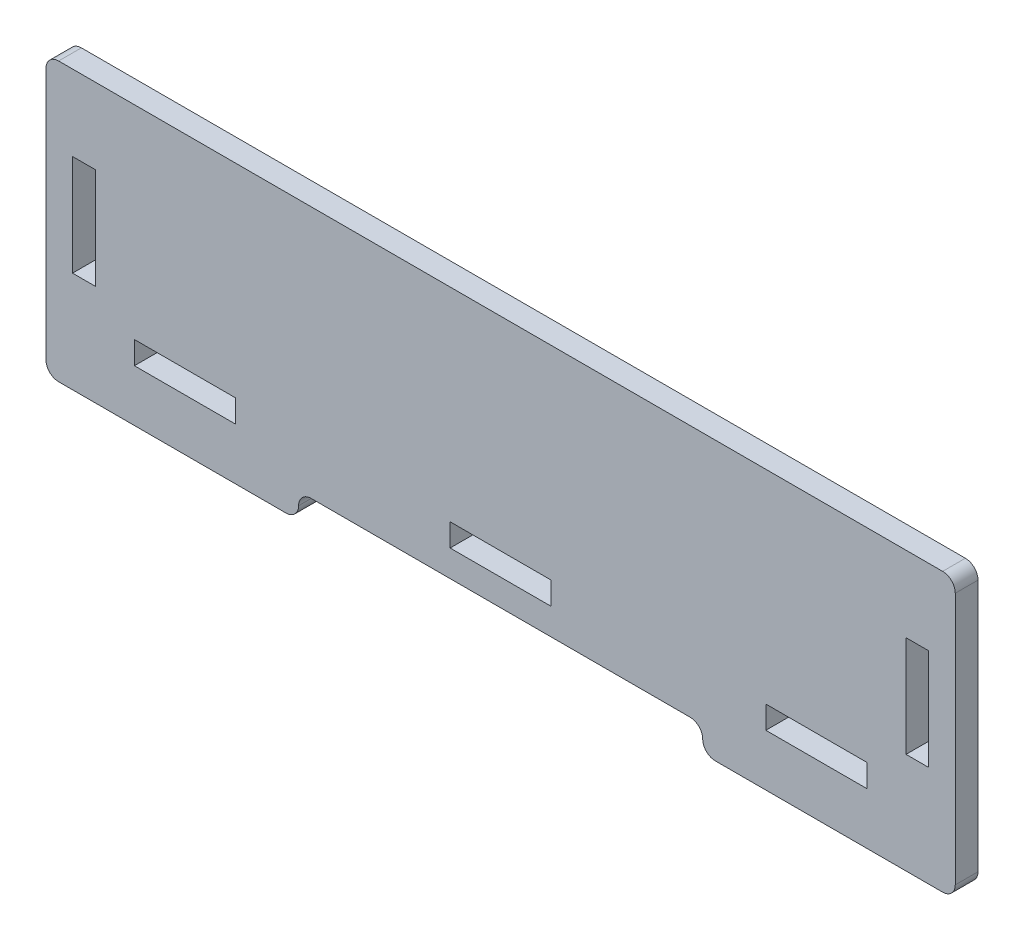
ISO-10303-21;
HEADER;
FILE_DESCRIPTION(('STEP AP214'),'2;1');
FILE_NAME('part.step','',(''),(''),'','','');
FILE_SCHEMA(('AUTOMOTIVE_DESIGN { 1 0 10303 214 1 1 1 1 }'));
ENDSEC;
DATA;
#1=APPLICATION_CONTEXT('core data for automotive mechanical design processes');
#2=APPLICATION_PROTOCOL_DEFINITION('international standard','automotive_design',2000,#1);
#3=PRODUCT_CONTEXT('',#1,'mechanical');
#4=PRODUCT('Part','Part','',(#3));
#5=PRODUCT_RELATED_PRODUCT_CATEGORY('part','',(#4));
#6=PRODUCT_DEFINITION_FORMATION('','',#4);
#7=PRODUCT_DEFINITION_CONTEXT('part definition',#1,'design');
#8=PRODUCT_DEFINITION('design','',#6,#7);
#9=PRODUCT_DEFINITION_SHAPE('','',#8);
#10=(LENGTH_UNIT() NAMED_UNIT(*) SI_UNIT(.MILLI.,.METRE.));
#11=(NAMED_UNIT(*) PLANE_ANGLE_UNIT() SI_UNIT($,.RADIAN.));
#12=(NAMED_UNIT(*) SI_UNIT($,.STERADIAN.) SOLID_ANGLE_UNIT());
#13=UNCERTAINTY_MEASURE_WITH_UNIT(LENGTH_MEASURE(1.E-05),#10,'distance_accuracy_value','');
#14=(GEOMETRIC_REPRESENTATION_CONTEXT(3) GLOBAL_UNCERTAINTY_ASSIGNED_CONTEXT((#13)) GLOBAL_UNIT_ASSIGNED_CONTEXT((#10,
#11,#12)) REPRESENTATION_CONTEXT('',''));
#15=CARTESIAN_POINT('',(0.,0.,0.));
#16=DIRECTION('',(0.,0.,1.));
#17=DIRECTION('',(1.,0.,0.));
#18=AXIS2_PLACEMENT_3D('',#15,#16,#17);
#19=CARTESIAN_POINT('',(-360.,-100.,18.));
#20=DIRECTION('',(0.,1.,0.));
#21=DIRECTION('',(0.,0.,1.));
#22=AXIS2_PLACEMENT_3D('',#19,#20,#21);
#23=PLANE('',#22);
#24=DIRECTION('',(1.,0.,0.));
#25=VECTOR('',#24,1.);
#26=CARTESIAN_POINT('',(-360.,-100.,0.));
#27=LINE('',#26,#25);
#28=CARTESIAN_POINT('',(-150.,-100.,0.));
#29=VERTEX_POINT('',#28);
#30=CARTESIAN_POINT('',(150.,-100.,0.));
#31=VERTEX_POINT('',#30);
#32=EDGE_CURVE('E521',#29,#31,#27,.T.);
#33=ORIENTED_EDGE('',*,*,#32,.T.);
#34=DIRECTION('',(0.,0.,1.));
#35=VECTOR('',#34,1.);
#36=CARTESIAN_POINT('',(150.,-100.,18.));
#37=LINE('',#36,#35);
#38=CARTESIAN_POINT('',(150.,-100.,18.));
#39=VERTEX_POINT('',#38);
#40=EDGE_CURVE('E556',#31,#39,#37,.T.);
#41=ORIENTED_EDGE('',*,*,#40,.T.);
#42=DIRECTION('',(1.,0.,0.));
#43=VECTOR('',#42,1.);
#44=CARTESIAN_POINT('',(-360.,-100.,18.));
#45=LINE('',#44,#43);
#46=CARTESIAN_POINT('',(-150.,-100.,18.));
#47=VERTEX_POINT('',#46);
#48=EDGE_CURVE('E601',#47,#39,#45,.T.);
#49=ORIENTED_EDGE('',*,*,#48,.F.);
#50=DIRECTION('',(0.,0.,1.));
#51=VECTOR('',#50,1.);
#52=CARTESIAN_POINT('',(-150.,-100.,18.));
#53=LINE('',#52,#51);
#54=EDGE_CURVE('E558',#47,#29,#53,.F.);
#55=ORIENTED_EDGE('',*,*,#54,.T.);
#56=EDGE_LOOP('',(#33,#41,#49,#55));
#57=FACE_BOUND('',#56,.T.);
#58=ADVANCED_FACE('F39',(#57),#23,.F.);
#59=CARTESIAN_POINT('',(360.,100.,18.));
#60=DIRECTION('',(-1.,0.,0.));
#61=DIRECTION('',(0.,-1.,0.));
#62=AXIS2_PLACEMENT_3D('',#59,#60,#61);
#63=PLANE('',#62);
#64=DIRECTION('',(0.,1.,0.));
#65=VECTOR('',#64,1.);
#66=CARTESIAN_POINT('',(360.,100.,0.));
#67=LINE('',#66,#65);
#68=CARTESIAN_POINT('',(360.,-110.,0.));
#69=VERTEX_POINT('',#68);
#70=CARTESIAN_POINT('',(360.,90.0000000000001,0.));
#71=VERTEX_POINT('',#70);
#72=EDGE_CURVE('E593',#69,#71,#67,.T.);
#73=ORIENTED_EDGE('',*,*,#72,.T.);
#74=DIRECTION('',(0.,0.,-1.));
#75=VECTOR('',#74,1.);
#76=CARTESIAN_POINT('',(360.,90.0000000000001,18.));
#77=LINE('',#76,#75);
#78=CARTESIAN_POINT('',(360.,90.0000000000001,18.));
#79=VERTEX_POINT('',#78);
#80=EDGE_CURVE('E62',#71,#79,#77,.F.);
#81=ORIENTED_EDGE('',*,*,#80,.T.);
#82=DIRECTION('',(0.,1.,0.));
#83=VECTOR('',#82,1.);
#84=CARTESIAN_POINT('',(360.,100.,18.));
#85=LINE('',#84,#83);
#86=CARTESIAN_POINT('',(360.,-110.,18.));
#87=VERTEX_POINT('',#86);
#88=EDGE_CURVE('E516',#87,#79,#85,.T.);
#89=ORIENTED_EDGE('',*,*,#88,.F.);
#90=DIRECTION('',(0.,0.,1.));
#91=VECTOR('',#90,1.);
#92=CARTESIAN_POINT('',(360.,-110.,0.));
#93=LINE('',#92,#91);
#94=EDGE_CURVE('E576',#87,#69,#93,.F.);
#95=ORIENTED_EDGE('',*,*,#94,.T.);
#96=EDGE_LOOP('',(#73,#81,#89,#95));
#97=FACE_BOUND('',#96,.T.);
#98=ADVANCED_FACE('F586',(#97),#63,.F.);
#99=CARTESIAN_POINT('',(-360.,100.,18.));
#100=DIRECTION('',(0.,-1.,0.));
#101=DIRECTION('',(0.,0.,-1.));
#102=AXIS2_PLACEMENT_3D('',#99,#100,#101);
#103=PLANE('',#102);
#104=DIRECTION('',(-1.,0.,0.));
#105=VECTOR('',#104,1.);
#106=CARTESIAN_POINT('',(-360.,100.,18.));
#107=LINE('',#106,#105);
#108=CARTESIAN_POINT('',(349.999999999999,100.,18.));
#109=VERTEX_POINT('',#108);
#110=CARTESIAN_POINT('',(-350.,100.,18.));
#111=VERTEX_POINT('',#110);
#112=EDGE_CURVE('E520',#109,#111,#107,.T.);
#113=ORIENTED_EDGE('',*,*,#112,.F.);
#114=DIRECTION('',(0.,0.,-1.));
#115=VECTOR('',#114,1.);
#116=CARTESIAN_POINT('',(350.,100.,18.));
#117=LINE('',#116,#115);
#118=CARTESIAN_POINT('',(349.999999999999,100.,0.));
#119=VERTEX_POINT('',#118);
#120=EDGE_CURVE('E537',#109,#119,#117,.T.);
#121=ORIENTED_EDGE('',*,*,#120,.T.);
#122=DIRECTION('',(-1.,0.,0.));
#123=VECTOR('',#122,1.);
#124=CARTESIAN_POINT('',(-360.,100.,0.));
#125=LINE('',#124,#123);
#126=CARTESIAN_POINT('',(-350.,100.,0.));
#127=VERTEX_POINT('',#126);
#128=EDGE_CURVE('E611',#119,#127,#125,.T.);
#129=ORIENTED_EDGE('',*,*,#128,.T.);
#130=DIRECTION('',(0.,0.,-1.));
#131=VECTOR('',#130,1.);
#132=CARTESIAN_POINT('',(-350.,100.,18.));
#133=LINE('',#132,#131);
#134=EDGE_CURVE('E540',#127,#111,#133,.F.);
#135=ORIENTED_EDGE('',*,*,#134,.T.);
#136=EDGE_LOOP('',(#113,#121,#129,#135));
#137=FACE_BOUND('',#136,.T.);
#138=ADVANCED_FACE('F673',(#137),#103,.F.);
#139=CARTESIAN_POINT('',(-360.,100.,18.));
#140=DIRECTION('',(1.,0.,0.));
#141=DIRECTION('',(0.,1.,0.));
#142=AXIS2_PLACEMENT_3D('',#139,#140,#141);
#143=PLANE('',#142);
#144=DIRECTION('',(0.,-1.,0.));
#145=VECTOR('',#144,1.);
#146=CARTESIAN_POINT('',(-360.,100.,18.));
#147=LINE('',#146,#145);
#148=CARTESIAN_POINT('',(-360.,90.0000000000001,18.));
#149=VERTEX_POINT('',#148);
#150=CARTESIAN_POINT('',(-360.,-110.,18.));
#151=VERTEX_POINT('',#150);
#152=EDGE_CURVE('E605',#149,#151,#147,.T.);
#153=ORIENTED_EDGE('',*,*,#152,.F.);
#154=DIRECTION('',(0.,0.,-1.));
#155=VECTOR('',#154,1.);
#156=CARTESIAN_POINT('',(-360.,90.0000000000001,18.));
#157=LINE('',#156,#155);
#158=CARTESIAN_POINT('',(-360.,90.0000000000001,0.));
#159=VERTEX_POINT('',#158);
#160=EDGE_CURVE('E12',#149,#159,#157,.T.);
#161=ORIENTED_EDGE('',*,*,#160,.T.);
#162=DIRECTION('',(0.,-1.,0.));
#163=VECTOR('',#162,1.);
#164=CARTESIAN_POINT('',(-360.,100.,0.));
#165=LINE('',#164,#163);
#166=CARTESIAN_POINT('',(-360.,-110.,0.));
#167=VERTEX_POINT('',#166);
#168=EDGE_CURVE('E609',#159,#167,#165,.T.);
#169=ORIENTED_EDGE('',*,*,#168,.T.);
#170=DIRECTION('',(0.,0.,1.));
#171=VECTOR('',#170,1.);
#172=CARTESIAN_POINT('',(-360.,-110.,18.));
#173=LINE('',#172,#171);
#174=EDGE_CURVE('E565',#167,#151,#173,.T.);
#175=ORIENTED_EDGE('',*,*,#174,.T.);
#176=EDGE_LOOP('',(#153,#161,#169,#175));
#177=FACE_BOUND('',#176,.T.);
#178=ADVANCED_FACE('F627',(#177),#143,.F.);
#179=CARTESIAN_POINT('',(0.,0.,18.));
#180=DIRECTION('',(0.,0.,1.));
#181=DIRECTION('',(1.,0.,0.));
#182=AXIS2_PLACEMENT_3D('',#179,#180,#181);
#183=PLANE('',#182);
#184=DIRECTION('',(0.,1.,0.));
#185=VECTOR('',#184,1.);
#186=CARTESIAN_POINT('',(290.,-60.9999999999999,18.));
#187=LINE('',#186,#185);
#188=CARTESIAN_POINT('',(290.,-78.9999999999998,18.));
#189=VERTEX_POINT('',#188);
#190=CARTESIAN_POINT('',(290.,-60.9999999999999,18.));
#191=VERTEX_POINT('',#190);
#192=EDGE_CURVE('E270',#189,#191,#187,.T.);
#193=ORIENTED_EDGE('',*,*,#192,.F.);
#194=DIRECTION('',(1.,0.,0.));
#195=VECTOR('',#194,1.);
#196=CARTESIAN_POINT('',(290.,-78.9999999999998,18.));
#197=LINE('',#196,#195);
#198=CARTESIAN_POINT('',(210.,-79.,18.));
#199=VERTEX_POINT('',#198);
#200=EDGE_CURVE('E288',#199,#189,#197,.T.);
#201=ORIENTED_EDGE('',*,*,#200,.F.);
#202=DIRECTION('',(0.,-1.,0.));
#203=VECTOR('',#202,1.);
#204=CARTESIAN_POINT('',(210.,-60.9999999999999,18.));
#205=LINE('',#204,#203);
#206=CARTESIAN_POINT('',(210.,-60.9999999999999,18.));
#207=VERTEX_POINT('',#206);
#208=EDGE_CURVE('E292',#207,#199,#205,.T.);
#209=ORIENTED_EDGE('',*,*,#208,.F.);
#210=DIRECTION('',(-1.,0.,0.));
#211=VECTOR('',#210,1.);
#212=CARTESIAN_POINT('',(290.,-60.9999999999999,18.));
#213=LINE('',#212,#211);
#214=EDGE_CURVE('E300',#191,#207,#213,.T.);
#215=ORIENTED_EDGE('',*,*,#214,.F.);
#216=EDGE_LOOP('',(#193,#201,#209,#215));
#217=FACE_BOUND('',#216,.T.);
#218=DIRECTION('',(0.,1.,0.));
#219=VECTOR('',#218,1.);
#220=CARTESIAN_POINT('',(39.9999999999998,-60.9999999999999,18.));
#221=LINE('',#220,#219);
#222=CARTESIAN_POINT('',(39.9999999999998,-79.0000000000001,18.));
#223=VERTEX_POINT('',#222);
#224=CARTESIAN_POINT('',(39.9999999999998,-60.9999999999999,18.));
#225=VERTEX_POINT('',#224);
#226=EDGE_CURVE('E331',#223,#225,#221,.T.);
#227=ORIENTED_EDGE('',*,*,#226,.F.);
#228=DIRECTION('',(1.,0.,0.));
#229=VECTOR('',#228,1.);
#230=CARTESIAN_POINT('',(-40.0000000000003,-79.0000000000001,18.));
#231=LINE('',#230,#229);
#232=CARTESIAN_POINT('',(-40.0000000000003,-79.0000000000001,18.));
#233=VERTEX_POINT('',#232);
#234=EDGE_CURVE('E321',#233,#223,#231,.T.);
#235=ORIENTED_EDGE('',*,*,#234,.F.);
#236=DIRECTION('',(0.,-1.,0.));
#237=VECTOR('',#236,1.);
#238=CARTESIAN_POINT('',(-40.0000000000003,-60.9999999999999,18.));
#239=LINE('',#238,#237);
#240=CARTESIAN_POINT('',(-40.0000000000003,-60.9999999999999,18.));
#241=VERTEX_POINT('',#240);
#242=EDGE_CURVE('E348',#241,#233,#239,.T.);
#243=ORIENTED_EDGE('',*,*,#242,.F.);
#244=DIRECTION('',(-1.,0.,0.));
#245=VECTOR('',#244,1.);
#246=CARTESIAN_POINT('',(-40.0000000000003,-60.9999999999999,18.));
#247=LINE('',#246,#245);
#248=EDGE_CURVE('E335',#225,#241,#247,.T.);
#249=ORIENTED_EDGE('',*,*,#248,.F.);
#250=EDGE_LOOP('',(#227,#235,#243,#249));
#251=FACE_BOUND('',#250,.T.);
#252=DIRECTION('',(0.,-1.,0.));
#253=VECTOR('',#252,1.);
#254=CARTESIAN_POINT('',(-339.,40.,18.));
#255=LINE('',#254,#253);
#256=CARTESIAN_POINT('',(-339.,40.,18.));
#257=VERTEX_POINT('',#256);
#258=CARTESIAN_POINT('',(-339.,-40.,18.));
#259=VERTEX_POINT('',#258);
#260=EDGE_CURVE('E371',#257,#259,#255,.T.);
#261=ORIENTED_EDGE('',*,*,#260,.F.);
#262=DIRECTION('',(-1.,0.,0.));
#263=VECTOR('',#262,1.);
#264=CARTESIAN_POINT('',(-321.,40.,18.));
#265=LINE('',#264,#263);
#266=CARTESIAN_POINT('',(-321.,40.,18.));
#267=VERTEX_POINT('',#266);
#268=EDGE_CURVE('E361',#267,#257,#265,.T.);
#269=ORIENTED_EDGE('',*,*,#268,.F.);
#270=DIRECTION('',(0.,1.,0.));
#271=VECTOR('',#270,1.);
#272=CARTESIAN_POINT('',(-321.,40.,18.));
#273=LINE('',#272,#271);
#274=CARTESIAN_POINT('',(-321.,-40.,18.));
#275=VERTEX_POINT('',#274);
#276=EDGE_CURVE('E388',#275,#267,#273,.T.);
#277=ORIENTED_EDGE('',*,*,#276,.F.);
#278=DIRECTION('',(1.,0.,0.));
#279=VECTOR('',#278,1.);
#280=CARTESIAN_POINT('',(-321.,-40.,18.));
#281=LINE('',#280,#279);
#282=EDGE_CURVE('E375',#259,#275,#281,.T.);
#283=ORIENTED_EDGE('',*,*,#282,.F.);
#284=EDGE_LOOP('',(#261,#269,#277,#283));
#285=FACE_BOUND('',#284,.T.);
#286=DIRECTION('',(0.,-1.,0.));
#287=VECTOR('',#286,1.);
#288=CARTESIAN_POINT('',(321.,40.0000000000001,18.));
#289=LINE('',#288,#287);
#290=CARTESIAN_POINT('',(321.,40.0000000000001,18.));
#291=VERTEX_POINT('',#290);
#292=CARTESIAN_POINT('',(321.,-39.9999999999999,18.));
#293=VERTEX_POINT('',#292);
#294=EDGE_CURVE('E411',#291,#293,#289,.T.);
#295=ORIENTED_EDGE('',*,*,#294,.F.);
#296=DIRECTION('',(-1.,0.,0.));
#297=VECTOR('',#296,1.);
#298=CARTESIAN_POINT('',(321.,40.0000000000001,18.));
#299=LINE('',#298,#297);
#300=CARTESIAN_POINT('',(339.,40.0000000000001,18.));
#301=VERTEX_POINT('',#300);
#302=EDGE_CURVE('E401',#301,#291,#299,.T.);
#303=ORIENTED_EDGE('',*,*,#302,.F.);
#304=DIRECTION('',(0.,1.,0.));
#305=VECTOR('',#304,1.);
#306=CARTESIAN_POINT('',(339.,40.0000000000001,18.));
#307=LINE('',#306,#305);
#308=CARTESIAN_POINT('',(339.,-39.9999999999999,18.));
#309=VERTEX_POINT('',#308);
#310=EDGE_CURVE('E427',#309,#301,#307,.T.);
#311=ORIENTED_EDGE('',*,*,#310,.F.);
#312=DIRECTION('',(1.,0.,0.));
#313=VECTOR('',#312,1.);
#314=CARTESIAN_POINT('',(321.,-39.9999999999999,18.));
#315=LINE('',#314,#313);
#316=EDGE_CURVE('E415',#293,#309,#315,.T.);
#317=ORIENTED_EDGE('',*,*,#316,.F.);
#318=EDGE_LOOP('',(#295,#303,#311,#317));
#319=FACE_BOUND('',#318,.T.);
#320=DIRECTION('',(0.,1.,0.));
#321=VECTOR('',#320,1.);
#322=CARTESIAN_POINT('',(-210.,-60.9999999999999,18.));
#323=LINE('',#322,#321);
#324=CARTESIAN_POINT('',(-210.,-79.,18.));
#325=VERTEX_POINT('',#324);
#326=CARTESIAN_POINT('',(-210.,-60.9999999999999,18.));
#327=VERTEX_POINT('',#326);
#328=EDGE_CURVE('E313',#325,#327,#323,.T.);
#329=ORIENTED_EDGE('',*,*,#328,.F.);
#330=DIRECTION('',(1.,0.,0.));
#331=VECTOR('',#330,1.);
#332=CARTESIAN_POINT('',(-290.,-79.,18.));
#333=LINE('',#332,#331);
#334=CARTESIAN_POINT('',(-290.,-79.,18.));
#335=VERTEX_POINT('',#334);
#336=EDGE_CURVE('E440',#335,#325,#333,.T.);
#337=ORIENTED_EDGE('',*,*,#336,.F.);
#338=DIRECTION('',(0.,-1.,0.));
#339=VECTOR('',#338,1.);
#340=CARTESIAN_POINT('',(-290.,-60.9999999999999,18.));
#341=LINE('',#340,#339);
#342=CARTESIAN_POINT('',(-290.,-60.9999999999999,18.));
#343=VERTEX_POINT('',#342);
#344=EDGE_CURVE('E465',#343,#335,#341,.T.);
#345=ORIENTED_EDGE('',*,*,#344,.F.);
#346=DIRECTION('',(-1.,0.,0.));
#347=VECTOR('',#346,1.);
#348=CARTESIAN_POINT('',(-290.,-60.9999999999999,18.));
#349=LINE('',#348,#347);
#350=EDGE_CURVE('E453',#327,#343,#349,.T.);
#351=ORIENTED_EDGE('',*,*,#350,.F.);
#352=EDGE_LOOP('',(#329,#337,#345,#351));
#353=FACE_BOUND('',#352,.T.);
#354=ORIENTED_EDGE('',*,*,#88,.T.);
#355=CARTESIAN_POINT('',(350.,90.0000000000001,18.));
#356=DIRECTION('',(0.,0.,1.));
#357=DIRECTION('',(1.,0.,0.));
#358=AXIS2_PLACEMENT_3D('',#355,#356,#357);
#359=CIRCLE('',#358,10.);
#360=EDGE_CURVE('E47',#79,#109,#359,.T.);
#361=ORIENTED_EDGE('',*,*,#360,.T.);
#362=ORIENTED_EDGE('',*,*,#112,.T.);
#363=CARTESIAN_POINT('',(-350.,90.0000000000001,18.));
#364=DIRECTION('',(0.,0.,1.));
#365=DIRECTION('',(1.,0.,0.));
#366=AXIS2_PLACEMENT_3D('',#363,#364,#365);
#367=CIRCLE('',#366,10.);
#368=EDGE_CURVE('E54',#111,#149,#367,.T.);
#369=ORIENTED_EDGE('',*,*,#368,.T.);
#370=ORIENTED_EDGE('',*,*,#152,.T.);
#371=CARTESIAN_POINT('',(-350.,-110.,18.));
#372=DIRECTION('',(0.,0.,1.));
#373=DIRECTION('',(1.,0.,0.));
#374=AXIS2_PLACEMENT_3D('',#371,#372,#373);
#375=CIRCLE('',#374,10.);
#376=CARTESIAN_POINT('',(-350.,-120.,18.));
#377=VERTEX_POINT('',#376);
#378=EDGE_CURVE('E498',#151,#377,#375,.T.);
#379=ORIENTED_EDGE('',*,*,#378,.T.);
#380=DIRECTION('',(1.,0.,0.));
#381=VECTOR('',#380,1.);
#382=CARTESIAN_POINT('',(-360.,-120.,18.));
#383=LINE('',#382,#381);
#384=CARTESIAN_POINT('',(-170.,-120.,18.));
#385=VERTEX_POINT('',#384);
#386=EDGE_CURVE('E479',#377,#385,#383,.T.);
#387=ORIENTED_EDGE('',*,*,#386,.T.);
#388=CARTESIAN_POINT('',(-170.,-110.,18.));
#389=DIRECTION('',(0.,0.,1.));
#390=DIRECTION('',(1.,0.,0.));
#391=AXIS2_PLACEMENT_3D('',#388,#389,#390);
#392=CIRCLE('',#391,10.);
#393=CARTESIAN_POINT('',(-160.,-110.,18.));
#394=VERTEX_POINT('',#393);
#395=EDGE_CURVE('E499',#385,#394,#392,.T.);
#396=ORIENTED_EDGE('',*,*,#395,.T.);
#397=CARTESIAN_POINT('',(-150.,-110.,18.));
#398=DIRECTION('',(0.,0.,1.));
#399=DIRECTION('',(1.,0.,0.));
#400=AXIS2_PLACEMENT_3D('',#397,#398,#399);
#401=CIRCLE('',#400,10.);
#402=EDGE_CURVE('E548',#394,#47,#401,.F.);
#403=ORIENTED_EDGE('',*,*,#402,.T.);
#404=ORIENTED_EDGE('',*,*,#48,.T.);
#405=CARTESIAN_POINT('',(150.,-110.,18.));
#406=DIRECTION('',(0.,0.,1.));
#407=DIRECTION('',(1.,0.,0.));
#408=AXIS2_PLACEMENT_3D('',#405,#406,#407);
#409=CIRCLE('',#408,10.);
#410=CARTESIAN_POINT('',(160.,-110.,18.));
#411=VERTEX_POINT('',#410);
#412=EDGE_CURVE('E553',#39,#411,#409,.F.);
#413=ORIENTED_EDGE('',*,*,#412,.T.);
#414=CARTESIAN_POINT('',(170.,-110.,18.));
#415=DIRECTION('',(0.,0.,1.));
#416=DIRECTION('',(1.,0.,0.));
#417=AXIS2_PLACEMENT_3D('',#414,#415,#416);
#418=CIRCLE('',#417,10.);
#419=CARTESIAN_POINT('',(170.,-120.,18.));
#420=VERTEX_POINT('',#419);
#421=EDGE_CURVE('E493',#411,#420,#418,.T.);
#422=ORIENTED_EDGE('',*,*,#421,.T.);
#423=DIRECTION('',(1.,0.,0.));
#424=VECTOR('',#423,1.);
#425=CARTESIAN_POINT('',(360.,-120.,18.));
#426=LINE('',#425,#424);
#427=CARTESIAN_POINT('',(350.,-120.,18.));
#428=VERTEX_POINT('',#427);
#429=EDGE_CURVE('E480',#420,#428,#426,.T.);
#430=ORIENTED_EDGE('',*,*,#429,.T.);
#431=CARTESIAN_POINT('',(350.,-110.,18.));
#432=DIRECTION('',(0.,0.,1.));
#433=DIRECTION('',(1.,0.,0.));
#434=AXIS2_PLACEMENT_3D('',#431,#432,#433);
#435=CIRCLE('',#434,10.);
#436=EDGE_CURVE('E504',#428,#87,#435,.T.);
#437=ORIENTED_EDGE('',*,*,#436,.T.);
#438=EDGE_LOOP('',(#354,#361,#362,#369,#370,#379,#387,#396,#403,#404,#413,#422,#430,#437));
#439=FACE_BOUND('',#438,.T.);
#440=ADVANCED_FACE('F580',(#217,#251,#285,#319,#353,#439),#183,.T.);
#441=CARTESIAN_POINT('',(0.,0.,0.));
#442=DIRECTION('',(0.,0.,1.));
#443=DIRECTION('',(1.,0.,0.));
#444=AXIS2_PLACEMENT_3D('',#441,#442,#443);
#445=PLANE('',#444);
#446=DIRECTION('',(1.,0.,0.));
#447=VECTOR('',#446,1.);
#448=CARTESIAN_POINT('',(290.,-78.9999999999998,0.));
#449=LINE('',#448,#447);
#450=CARTESIAN_POINT('',(210.,-79.,0.));
#451=VERTEX_POINT('',#450);
#452=CARTESIAN_POINT('',(290.,-78.9999999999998,0.));
#453=VERTEX_POINT('',#452);
#454=EDGE_CURVE('E275',#451,#453,#449,.T.);
#455=ORIENTED_EDGE('',*,*,#454,.T.);
#456=DIRECTION('',(0.,1.,0.));
#457=VECTOR('',#456,1.);
#458=CARTESIAN_POINT('',(290.,-60.9999999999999,0.));
#459=LINE('',#458,#457);
#460=CARTESIAN_POINT('',(290.,-60.9999999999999,0.));
#461=VERTEX_POINT('',#460);
#462=EDGE_CURVE('E267',#453,#461,#459,.T.);
#463=ORIENTED_EDGE('',*,*,#462,.T.);
#464=DIRECTION('',(-1.,0.,0.));
#465=VECTOR('',#464,1.);
#466=CARTESIAN_POINT('',(290.,-60.9999999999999,0.));
#467=LINE('',#466,#465);
#468=CARTESIAN_POINT('',(210.,-60.9999999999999,0.));
#469=VERTEX_POINT('',#468);
#470=EDGE_CURVE('E279',#461,#469,#467,.T.);
#471=ORIENTED_EDGE('',*,*,#470,.T.);
#472=DIRECTION('',(0.,-1.,0.));
#473=VECTOR('',#472,1.);
#474=CARTESIAN_POINT('',(210.,-60.9999999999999,0.));
#475=LINE('',#474,#473);
#476=EDGE_CURVE('E283',#469,#451,#475,.T.);
#477=ORIENTED_EDGE('',*,*,#476,.T.);
#478=EDGE_LOOP('',(#455,#463,#471,#477));
#479=FACE_BOUND('',#478,.T.);
#480=DIRECTION('',(1.,0.,0.));
#481=VECTOR('',#480,1.);
#482=CARTESIAN_POINT('',(-40.0000000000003,-79.0000000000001,0.));
#483=LINE('',#482,#481);
#484=CARTESIAN_POINT('',(-40.0000000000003,-79.0000000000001,0.));
#485=VERTEX_POINT('',#484);
#486=CARTESIAN_POINT('',(39.9999999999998,-79.0000000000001,0.));
#487=VERTEX_POINT('',#486);
#488=EDGE_CURVE('E327',#485,#487,#483,.T.);
#489=ORIENTED_EDGE('',*,*,#488,.T.);
#490=DIRECTION('',(0.,1.,0.));
#491=VECTOR('',#490,1.);
#492=CARTESIAN_POINT('',(39.9999999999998,-60.9999999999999,0.));
#493=LINE('',#492,#491);
#494=CARTESIAN_POINT('',(39.9999999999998,-60.9999999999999,0.));
#495=VERTEX_POINT('',#494);
#496=EDGE_CURVE('E317',#487,#495,#493,.T.);
#497=ORIENTED_EDGE('',*,*,#496,.T.);
#498=DIRECTION('',(-1.,0.,0.));
#499=VECTOR('',#498,1.);
#500=CARTESIAN_POINT('',(-40.0000000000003,-60.9999999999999,0.));
#501=LINE('',#500,#499);
#502=CARTESIAN_POINT('',(-40.0000000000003,-60.9999999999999,0.));
#503=VERTEX_POINT('',#502);
#504=EDGE_CURVE('E320',#495,#503,#501,.T.);
#505=ORIENTED_EDGE('',*,*,#504,.T.);
#506=DIRECTION('',(0.,-1.,0.));
#507=VECTOR('',#506,1.);
#508=CARTESIAN_POINT('',(-40.0000000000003,-60.9999999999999,0.));
#509=LINE('',#508,#507);
#510=EDGE_CURVE('E324',#503,#485,#509,.T.);
#511=ORIENTED_EDGE('',*,*,#510,.T.);
#512=EDGE_LOOP('',(#489,#497,#505,#511));
#513=FACE_BOUND('',#512,.T.);
#514=DIRECTION('',(-1.,0.,0.));
#515=VECTOR('',#514,1.);
#516=CARTESIAN_POINT('',(-321.,40.,0.));
#517=LINE('',#516,#515);
#518=CARTESIAN_POINT('',(-321.,40.,0.));
#519=VERTEX_POINT('',#518);
#520=CARTESIAN_POINT('',(-339.,40.,0.));
#521=VERTEX_POINT('',#520);
#522=EDGE_CURVE('E367',#519,#521,#517,.T.);
#523=ORIENTED_EDGE('',*,*,#522,.T.);
#524=DIRECTION('',(0.,-1.,0.));
#525=VECTOR('',#524,1.);
#526=CARTESIAN_POINT('',(-339.,40.,0.));
#527=LINE('',#526,#525);
#528=CARTESIAN_POINT('',(-339.,-40.,0.));
#529=VERTEX_POINT('',#528);
#530=EDGE_CURVE('E357',#521,#529,#527,.T.);
#531=ORIENTED_EDGE('',*,*,#530,.T.);
#532=DIRECTION('',(1.,0.,0.));
#533=VECTOR('',#532,1.);
#534=CARTESIAN_POINT('',(-321.,-40.,0.));
#535=LINE('',#534,#533);
#536=CARTESIAN_POINT('',(-321.,-40.,0.));
#537=VERTEX_POINT('',#536);
#538=EDGE_CURVE('E360',#529,#537,#535,.T.);
#539=ORIENTED_EDGE('',*,*,#538,.T.);
#540=DIRECTION('',(0.,1.,0.));
#541=VECTOR('',#540,1.);
#542=CARTESIAN_POINT('',(-321.,40.,0.));
#543=LINE('',#542,#541);
#544=EDGE_CURVE('E364',#537,#519,#543,.T.);
#545=ORIENTED_EDGE('',*,*,#544,.T.);
#546=EDGE_LOOP('',(#523,#531,#539,#545));
#547=FACE_BOUND('',#546,.T.);
#548=DIRECTION('',(-1.,0.,0.));
#549=VECTOR('',#548,1.);
#550=CARTESIAN_POINT('',(321.,40.0000000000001,0.));
#551=LINE('',#550,#549);
#552=CARTESIAN_POINT('',(339.,40.0000000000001,0.));
#553=VERTEX_POINT('',#552);
#554=CARTESIAN_POINT('',(321.,40.0000000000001,0.));
#555=VERTEX_POINT('',#554);
#556=EDGE_CURVE('E407',#553,#555,#551,.T.);
#557=ORIENTED_EDGE('',*,*,#556,.T.);
#558=DIRECTION('',(0.,-1.,0.));
#559=VECTOR('',#558,1.);
#560=CARTESIAN_POINT('',(321.,40.0000000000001,0.));
#561=LINE('',#560,#559);
#562=CARTESIAN_POINT('',(321.,-39.9999999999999,0.));
#563=VERTEX_POINT('',#562);
#564=EDGE_CURVE('E397',#555,#563,#561,.T.);
#565=ORIENTED_EDGE('',*,*,#564,.T.);
#566=DIRECTION('',(1.,0.,0.));
#567=VECTOR('',#566,1.);
#568=CARTESIAN_POINT('',(321.,-39.9999999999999,0.));
#569=LINE('',#568,#567);
#570=CARTESIAN_POINT('',(339.,-39.9999999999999,0.));
#571=VERTEX_POINT('',#570);
#572=EDGE_CURVE('E400',#563,#571,#569,.T.);
#573=ORIENTED_EDGE('',*,*,#572,.T.);
#574=DIRECTION('',(0.,1.,0.));
#575=VECTOR('',#574,1.);
#576=CARTESIAN_POINT('',(339.,40.0000000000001,0.));
#577=LINE('',#576,#575);
#578=EDGE_CURVE('E404',#571,#553,#577,.T.);
#579=ORIENTED_EDGE('',*,*,#578,.T.);
#580=EDGE_LOOP('',(#557,#565,#573,#579));
#581=FACE_BOUND('',#580,.T.);
#582=DIRECTION('',(1.,0.,0.));
#583=VECTOR('',#582,1.);
#584=CARTESIAN_POINT('',(-290.,-79.,0.));
#585=LINE('',#584,#583);
#586=CARTESIAN_POINT('',(-290.,-79.,0.));
#587=VERTEX_POINT('',#586);
#588=CARTESIAN_POINT('',(-210.,-79.,0.));
#589=VERTEX_POINT('',#588);
#590=EDGE_CURVE('E446',#587,#589,#585,.T.);
#591=ORIENTED_EDGE('',*,*,#590,.T.);
#592=DIRECTION('',(0.,1.,0.));
#593=VECTOR('',#592,1.);
#594=CARTESIAN_POINT('',(-210.,-60.9999999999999,0.));
#595=LINE('',#594,#593);
#596=CARTESIAN_POINT('',(-210.,-60.9999999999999,0.));
#597=VERTEX_POINT('',#596);
#598=EDGE_CURVE('E436',#589,#597,#595,.T.);
#599=ORIENTED_EDGE('',*,*,#598,.T.);
#600=DIRECTION('',(-1.,0.,0.));
#601=VECTOR('',#600,1.);
#602=CARTESIAN_POINT('',(-290.,-60.9999999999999,0.));
#603=LINE('',#602,#601);
#604=CARTESIAN_POINT('',(-290.,-60.9999999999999,0.));
#605=VERTEX_POINT('',#604);
#606=EDGE_CURVE('E439',#597,#605,#603,.T.);
#607=ORIENTED_EDGE('',*,*,#606,.T.);
#608=DIRECTION('',(0.,-1.,0.));
#609=VECTOR('',#608,1.);
#610=CARTESIAN_POINT('',(-290.,-60.9999999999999,0.));
#611=LINE('',#610,#609);
#612=EDGE_CURVE('E443',#605,#587,#611,.T.);
#613=ORIENTED_EDGE('',*,*,#612,.T.);
#614=EDGE_LOOP('',(#591,#599,#607,#613));
#615=FACE_BOUND('',#614,.T.);
#616=ORIENTED_EDGE('',*,*,#128,.F.);
#617=CARTESIAN_POINT('',(350.,90.0000000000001,0.));
#618=DIRECTION('',(0.,0.,1.));
#619=DIRECTION('',(1.,0.,0.));
#620=AXIS2_PLACEMENT_3D('',#617,#618,#619);
#621=CIRCLE('',#620,10.);
#622=EDGE_CURVE('E533',#119,#71,#621,.F.);
#623=ORIENTED_EDGE('',*,*,#622,.T.);
#624=ORIENTED_EDGE('',*,*,#72,.F.);
#625=CARTESIAN_POINT('',(350.,-110.,0.));
#626=DIRECTION('',(0.,0.,1.));
#627=DIRECTION('',(1.,0.,0.));
#628=AXIS2_PLACEMENT_3D('',#625,#626,#627);
#629=CIRCLE('',#628,10.);
#630=CARTESIAN_POINT('',(350.,-120.,0.));
#631=VERTEX_POINT('',#630);
#632=EDGE_CURVE('E568',#69,#631,#629,.F.);
#633=ORIENTED_EDGE('',*,*,#632,.T.);
#634=DIRECTION('',(1.,0.,0.));
#635=VECTOR('',#634,1.);
#636=CARTESIAN_POINT('',(360.,-120.,0.));
#637=LINE('',#636,#635);
#638=CARTESIAN_POINT('',(170.,-120.,0.));
#639=VERTEX_POINT('',#638);
#640=EDGE_CURVE('E476',#639,#631,#637,.T.);
#641=ORIENTED_EDGE('',*,*,#640,.F.);
#642=CARTESIAN_POINT('',(170.,-110.,0.));
#643=DIRECTION('',(0.,0.,1.));
#644=DIRECTION('',(1.,0.,0.));
#645=AXIS2_PLACEMENT_3D('',#642,#643,#644);
#646=CIRCLE('',#645,10.);
#647=CARTESIAN_POINT('',(160.,-110.,0.));
#648=VERTEX_POINT('',#647);
#649=EDGE_CURVE('E573',#639,#648,#646,.F.);
#650=ORIENTED_EDGE('',*,*,#649,.T.);
#651=CARTESIAN_POINT('',(150.,-110.,0.));
#652=DIRECTION('',(0.,0.,1.));
#653=DIRECTION('',(1.,0.,0.));
#654=AXIS2_PLACEMENT_3D('',#651,#652,#653);
#655=CIRCLE('',#654,10.);
#656=EDGE_CURVE('E551',#648,#31,#655,.T.);
#657=ORIENTED_EDGE('',*,*,#656,.T.);
#658=ORIENTED_EDGE('',*,*,#32,.F.);
#659=CARTESIAN_POINT('',(-150.,-110.,0.));
#660=DIRECTION('',(0.,0.,1.));
#661=DIRECTION('',(1.,0.,0.));
#662=AXIS2_PLACEMENT_3D('',#659,#660,#661);
#663=CIRCLE('',#662,10.);
#664=CARTESIAN_POINT('',(-160.,-110.,0.));
#665=VERTEX_POINT('',#664);
#666=EDGE_CURVE('E542',#29,#665,#663,.T.);
#667=ORIENTED_EDGE('',*,*,#666,.T.);
#668=CARTESIAN_POINT('',(-170.,-110.,0.));
#669=DIRECTION('',(0.,0.,1.));
#670=DIRECTION('',(1.,0.,0.));
#671=AXIS2_PLACEMENT_3D('',#668,#669,#670);
#672=CIRCLE('',#671,10.);
#673=CARTESIAN_POINT('',(-170.,-120.,0.));
#674=VERTEX_POINT('',#673);
#675=EDGE_CURVE('E575',#665,#674,#672,.F.);
#676=ORIENTED_EDGE('',*,*,#675,.T.);
#677=DIRECTION('',(1.,0.,0.));
#678=VECTOR('',#677,1.);
#679=CARTESIAN_POINT('',(-360.,-120.,0.));
#680=LINE('',#679,#678);
#681=CARTESIAN_POINT('',(-350.,-120.,0.));
#682=VERTEX_POINT('',#681);
#683=EDGE_CURVE('E486',#682,#674,#680,.T.);
#684=ORIENTED_EDGE('',*,*,#683,.F.);
#685=CARTESIAN_POINT('',(-350.,-110.,0.));
#686=DIRECTION('',(0.,0.,1.));
#687=DIRECTION('',(1.,0.,0.));
#688=AXIS2_PLACEMENT_3D('',#685,#686,#687);
#689=CIRCLE('',#688,10.);
#690=EDGE_CURVE('E570',#682,#167,#689,.F.);
#691=ORIENTED_EDGE('',*,*,#690,.T.);
#692=ORIENTED_EDGE('',*,*,#168,.F.);
#693=CARTESIAN_POINT('',(-350.,90.0000000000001,0.));
#694=DIRECTION('',(0.,0.,1.));
#695=DIRECTION('',(1.,0.,0.));
#696=AXIS2_PLACEMENT_3D('',#693,#694,#695);
#697=CIRCLE('',#696,10.);
#698=EDGE_CURVE('E535',#159,#127,#697,.F.);
#699=ORIENTED_EDGE('',*,*,#698,.T.);
#700=EDGE_LOOP('',(#616,#623,#624,#633,#641,#650,#657,#658,#667,#676,#684,#691,#692,#699));
#701=FACE_BOUND('',#700,.T.);
#702=ADVANCED_FACE('F285',(#479,#513,#547,#581,#615,#701),#445,.F.);
#703=CARTESIAN_POINT('',(-360.,-120.,0.));
#704=DIRECTION('',(0.,-1.,0.));
#705=DIRECTION('',(0.,0.,-1.));
#706=AXIS2_PLACEMENT_3D('',#703,#704,#705);
#707=PLANE('',#706);
#708=ORIENTED_EDGE('',*,*,#386,.F.);
#709=DIRECTION('',(0.,0.,1.));
#710=VECTOR('',#709,1.);
#711=CARTESIAN_POINT('',(-350.,-120.,0.));
#712=LINE('',#711,#710);
#713=EDGE_CURVE('E560',#377,#682,#712,.F.);
#714=ORIENTED_EDGE('',*,*,#713,.T.);
#715=ORIENTED_EDGE('',*,*,#683,.T.);
#716=DIRECTION('',(0.,0.,1.));
#717=VECTOR('',#716,1.);
#718=CARTESIAN_POINT('',(-170.,-120.,0.));
#719=LINE('',#718,#717);
#720=EDGE_CURVE('E562',#674,#385,#719,.T.);
#721=ORIENTED_EDGE('',*,*,#720,.T.);
#722=EDGE_LOOP('',(#708,#714,#715,#721));
#723=FACE_BOUND('',#722,.T.);
#724=ADVANCED_FACE('F637',(#723),#707,.T.);
#725=CARTESIAN_POINT('',(360.,-120.,0.));
#726=DIRECTION('',(0.,-1.,0.));
#727=DIRECTION('',(0.,0.,-1.));
#728=AXIS2_PLACEMENT_3D('',#725,#726,#727);
#729=PLANE('',#728);
#730=ORIENTED_EDGE('',*,*,#640,.T.);
#731=DIRECTION('',(0.,0.,1.));
#732=VECTOR('',#731,1.);
#733=CARTESIAN_POINT('',(350.,-120.,18.));
#734=LINE('',#733,#732);
#735=EDGE_CURVE('E589',#631,#428,#734,.T.);
#736=ORIENTED_EDGE('',*,*,#735,.T.);
#737=ORIENTED_EDGE('',*,*,#429,.F.);
#738=DIRECTION('',(0.,0.,1.));
#739=VECTOR('',#738,1.);
#740=CARTESIAN_POINT('',(170.,-120.,0.));
#741=LINE('',#740,#739);
#742=EDGE_CURVE('E598',#420,#639,#741,.F.);
#743=ORIENTED_EDGE('',*,*,#742,.T.);
#744=EDGE_LOOP('',(#730,#736,#737,#743));
#745=FACE_BOUND('',#744,.T.);
#746=ADVANCED_FACE('F596',(#745),#729,.T.);
#747=CARTESIAN_POINT('',(350.,-110.,0.));
#748=DIRECTION('',(0.,0.,-1.));
#749=DIRECTION('',(-1.,0.,0.));
#750=AXIS2_PLACEMENT_3D('',#747,#748,#749);
#751=CYLINDRICAL_SURFACE('',#750,10.);
#752=ORIENTED_EDGE('',*,*,#632,.F.);
#753=ORIENTED_EDGE('',*,*,#94,.F.);
#754=ORIENTED_EDGE('',*,*,#436,.F.);
#755=ORIENTED_EDGE('',*,*,#735,.F.);
#756=EDGE_LOOP('',(#752,#753,#754,#755));
#757=FACE_BOUND('',#756,.T.);
#758=ADVANCED_FACE('F588',(#757),#751,.T.);
#759=CARTESIAN_POINT('',(-350.,-110.,18.));
#760=DIRECTION('',(0.,0.,-1.));
#761=DIRECTION('',(-1.,0.,0.));
#762=AXIS2_PLACEMENT_3D('',#759,#760,#761);
#763=CYLINDRICAL_SURFACE('',#762,10.);
#764=ORIENTED_EDGE('',*,*,#690,.F.);
#765=ORIENTED_EDGE('',*,*,#713,.F.);
#766=ORIENTED_EDGE('',*,*,#378,.F.);
#767=ORIENTED_EDGE('',*,*,#174,.F.);
#768=EDGE_LOOP('',(#764,#765,#766,#767));
#769=FACE_BOUND('',#768,.T.);
#770=ADVANCED_FACE('F634',(#769),#763,.T.);
#771=CARTESIAN_POINT('',(150.,-110.,18.));
#772=DIRECTION('',(0.,0.,1.));
#773=DIRECTION('',(1.,0.,0.));
#774=AXIS2_PLACEMENT_3D('',#771,#772,#773);
#775=CYLINDRICAL_SURFACE('',#774,10.);
#776=ORIENTED_EDGE('',*,*,#40,.F.);
#777=ORIENTED_EDGE('',*,*,#656,.F.);
#778=DIRECTION('',(0.,0.,1.));
#779=VECTOR('',#778,1.);
#780=CARTESIAN_POINT('',(160.,-110.,0.));
#781=LINE('',#780,#779);
#782=EDGE_CURVE('E485',#411,#648,#781,.F.);
#783=ORIENTED_EDGE('',*,*,#782,.F.);
#784=ORIENTED_EDGE('',*,*,#412,.F.);
#785=EDGE_LOOP('',(#776,#777,#783,#784));
#786=FACE_BOUND('',#785,.T.);
#787=ADVANCED_FACE('F656',(#786),#775,.F.);
#788=CARTESIAN_POINT('',(170.,-110.,0.));
#789=DIRECTION('',(0.,0.,1.));
#790=DIRECTION('',(1.,0.,0.));
#791=AXIS2_PLACEMENT_3D('',#788,#789,#790);
#792=CYLINDRICAL_SURFACE('',#791,10.);
#793=ORIENTED_EDGE('',*,*,#649,.F.);
#794=ORIENTED_EDGE('',*,*,#742,.F.);
#795=ORIENTED_EDGE('',*,*,#421,.F.);
#796=ORIENTED_EDGE('',*,*,#782,.T.);
#797=EDGE_LOOP('',(#793,#794,#795,#796));
#798=FACE_BOUND('',#797,.T.);
#799=ADVANCED_FACE('F658',(#798),#792,.T.);
#800=CARTESIAN_POINT('',(-150.,-110.,0.));
#801=DIRECTION('',(0.,0.,1.));
#802=DIRECTION('',(1.,0.,0.));
#803=AXIS2_PLACEMENT_3D('',#800,#801,#802);
#804=CYLINDRICAL_SURFACE('',#803,10.);
#805=DIRECTION('',(0.,0.,1.));
#806=VECTOR('',#805,1.);
#807=CARTESIAN_POINT('',(-160.,-110.,0.));
#808=LINE('',#807,#806);
#809=EDGE_CURVE('E469',#665,#394,#808,.T.);
#810=ORIENTED_EDGE('',*,*,#809,.F.);
#811=ORIENTED_EDGE('',*,*,#666,.F.);
#812=ORIENTED_EDGE('',*,*,#54,.F.);
#813=ORIENTED_EDGE('',*,*,#402,.F.);
#814=EDGE_LOOP('',(#810,#811,#812,#813));
#815=FACE_BOUND('',#814,.T.);
#816=ADVANCED_FACE('F648',(#815),#804,.F.);
#817=CARTESIAN_POINT('',(-170.,-110.,0.));
#818=DIRECTION('',(0.,0.,1.));
#819=DIRECTION('',(1.,0.,0.));
#820=AXIS2_PLACEMENT_3D('',#817,#818,#819);
#821=CYLINDRICAL_SURFACE('',#820,10.);
#822=ORIENTED_EDGE('',*,*,#675,.F.);
#823=ORIENTED_EDGE('',*,*,#809,.T.);
#824=ORIENTED_EDGE('',*,*,#395,.F.);
#825=ORIENTED_EDGE('',*,*,#720,.F.);
#826=EDGE_LOOP('',(#822,#823,#824,#825));
#827=FACE_BOUND('',#826,.T.);
#828=ADVANCED_FACE('F641',(#827),#821,.T.);
#829=CARTESIAN_POINT('',(-210.,-60.9999999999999,0.));
#830=DIRECTION('',(1.,0.,0.));
#831=DIRECTION('',(0.,0.,-1.));
#832=AXIS2_PLACEMENT_3D('',#829,#830,#831);
#833=PLANE('',#832);
#834=ORIENTED_EDGE('',*,*,#328,.T.);
#835=DIRECTION('',(0.,0.,1.));
#836=VECTOR('',#835,1.);
#837=CARTESIAN_POINT('',(-210.,-60.9999999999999,0.));
#838=LINE('',#837,#836);
#839=EDGE_CURVE('E449',#597,#327,#838,.T.);
#840=ORIENTED_EDGE('',*,*,#839,.F.);
#841=ORIENTED_EDGE('',*,*,#598,.F.);
#842=DIRECTION('',(0.,0.,1.));
#843=VECTOR('',#842,1.);
#844=CARTESIAN_POINT('',(-210.,-79.,0.));
#845=LINE('',#844,#843);
#846=EDGE_CURVE('E467',#589,#325,#845,.T.);
#847=ORIENTED_EDGE('',*,*,#846,.T.);
#848=EDGE_LOOP('',(#834,#840,#841,#847));
#849=FACE_BOUND('',#848,.T.);
#850=ADVANCED_FACE('F712',(#849),#833,.F.);
#851=CARTESIAN_POINT('',(-290.,-79.,0.));
#852=DIRECTION('',(0.,-1.,0.));
#853=DIRECTION('',(1.,0.,0.));
#854=AXIS2_PLACEMENT_3D('',#851,#852,#853);
#855=PLANE('',#854);
#856=ORIENTED_EDGE('',*,*,#336,.T.);
#857=ORIENTED_EDGE('',*,*,#846,.F.);
#858=ORIENTED_EDGE('',*,*,#590,.F.);
#859=DIRECTION('',(0.,0.,1.));
#860=VECTOR('',#859,1.);
#861=CARTESIAN_POINT('',(-290.,-79.,0.));
#862=LINE('',#861,#860);
#863=EDGE_CURVE('E470',#587,#335,#862,.T.);
#864=ORIENTED_EDGE('',*,*,#863,.T.);
#865=EDGE_LOOP('',(#856,#857,#858,#864));
#866=FACE_BOUND('',#865,.T.);
#867=ADVANCED_FACE('F721',(#866),#855,.F.);
#868=CARTESIAN_POINT('',(-290.,-60.9999999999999,0.));
#869=DIRECTION('',(-1.,0.,0.));
#870=DIRECTION('',(0.,0.,1.));
#871=AXIS2_PLACEMENT_3D('',#868,#869,#870);
#872=PLANE('',#871);
#873=ORIENTED_EDGE('',*,*,#344,.T.);
#874=ORIENTED_EDGE('',*,*,#863,.F.);
#875=ORIENTED_EDGE('',*,*,#612,.F.);
#876=DIRECTION('',(0.,0.,1.));
#877=VECTOR('',#876,1.);
#878=CARTESIAN_POINT('',(-290.,-60.9999999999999,0.));
#879=LINE('',#878,#877);
#880=EDGE_CURVE('E472',#605,#343,#879,.T.);
#881=ORIENTED_EDGE('',*,*,#880,.T.);
#882=EDGE_LOOP('',(#873,#874,#875,#881));
#883=FACE_BOUND('',#882,.T.);
#884=ADVANCED_FACE('F731',(#883),#872,.F.);
#885=CARTESIAN_POINT('',(-290.,-60.9999999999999,0.));
#886=DIRECTION('',(0.,1.,0.));
#887=DIRECTION('',(0.,0.,1.));
#888=AXIS2_PLACEMENT_3D('',#885,#886,#887);
#889=PLANE('',#888);
#890=ORIENTED_EDGE('',*,*,#350,.T.);
#891=ORIENTED_EDGE('',*,*,#880,.F.);
#892=ORIENTED_EDGE('',*,*,#606,.F.);
#893=ORIENTED_EDGE('',*,*,#839,.T.);
#894=EDGE_LOOP('',(#890,#891,#892,#893));
#895=FACE_BOUND('',#894,.T.);
#896=ADVANCED_FACE('F741',(#895),#889,.F.);
#897=CARTESIAN_POINT('',(321.,40.0000000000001,0.));
#898=DIRECTION('',(-1.,0.,0.));
#899=DIRECTION('',(0.,0.,1.));
#900=AXIS2_PLACEMENT_3D('',#897,#898,#899);
#901=PLANE('',#900);
#902=ORIENTED_EDGE('',*,*,#294,.T.);
#903=DIRECTION('',(0.,0.,1.));
#904=VECTOR('',#903,1.);
#905=CARTESIAN_POINT('',(321.,-39.9999999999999,0.));
#906=LINE('',#905,#904);
#907=EDGE_CURVE('E410',#563,#293,#906,.T.);
#908=ORIENTED_EDGE('',*,*,#907,.F.);
#909=ORIENTED_EDGE('',*,*,#564,.F.);
#910=DIRECTION('',(0.,0.,1.));
#911=VECTOR('',#910,1.);
#912=CARTESIAN_POINT('',(321.,40.0000000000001,0.));
#913=LINE('',#912,#911);
#914=EDGE_CURVE('E376',#555,#291,#913,.T.);
#915=ORIENTED_EDGE('',*,*,#914,.T.);
#916=EDGE_LOOP('',(#902,#908,#909,#915));
#917=FACE_BOUND('',#916,.T.);
#918=ADVANCED_FACE('F751',(#917),#901,.F.);
#919=CARTESIAN_POINT('',(321.,40.0000000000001,0.));
#920=DIRECTION('',(0.,1.,0.));
#921=DIRECTION('',(-1.,0.,0.));
#922=AXIS2_PLACEMENT_3D('',#919,#920,#921);
#923=PLANE('',#922);
#924=ORIENTED_EDGE('',*,*,#302,.T.);
#925=ORIENTED_EDGE('',*,*,#914,.F.);
#926=ORIENTED_EDGE('',*,*,#556,.F.);
#927=DIRECTION('',(0.,0.,1.));
#928=VECTOR('',#927,1.);
#929=CARTESIAN_POINT('',(339.,40.0000000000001,0.));
#930=LINE('',#929,#928);
#931=EDGE_CURVE('E430',#553,#301,#930,.T.);
#932=ORIENTED_EDGE('',*,*,#931,.T.);
#933=EDGE_LOOP('',(#924,#925,#926,#932));
#934=FACE_BOUND('',#933,.T.);
#935=ADVANCED_FACE('F761',(#934),#923,.F.);
#936=CARTESIAN_POINT('',(339.,40.0000000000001,0.));
#937=DIRECTION('',(1.,0.,0.));
#938=DIRECTION('',(0.,0.,-1.));
#939=AXIS2_PLACEMENT_3D('',#936,#937,#938);
#940=PLANE('',#939);
#941=ORIENTED_EDGE('',*,*,#310,.T.);
#942=ORIENTED_EDGE('',*,*,#931,.F.);
#943=ORIENTED_EDGE('',*,*,#578,.F.);
#944=DIRECTION('',(0.,0.,1.));
#945=VECTOR('',#944,1.);
#946=CARTESIAN_POINT('',(339.,-39.9999999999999,0.));
#947=LINE('',#946,#945);
#948=EDGE_CURVE('E432',#571,#309,#947,.T.);
#949=ORIENTED_EDGE('',*,*,#948,.T.);
#950=EDGE_LOOP('',(#941,#942,#943,#949));
#951=FACE_BOUND('',#950,.T.);
#952=ADVANCED_FACE('F771',(#951),#940,.F.);
#953=CARTESIAN_POINT('',(321.,-39.9999999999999,0.));
#954=DIRECTION('',(0.,-1.,0.));
#955=DIRECTION('',(1.,0.,0.));
#956=AXIS2_PLACEMENT_3D('',#953,#954,#955);
#957=PLANE('',#956);
#958=ORIENTED_EDGE('',*,*,#316,.T.);
#959=ORIENTED_EDGE('',*,*,#948,.F.);
#960=ORIENTED_EDGE('',*,*,#572,.F.);
#961=ORIENTED_EDGE('',*,*,#907,.T.);
#962=EDGE_LOOP('',(#958,#959,#960,#961));
#963=FACE_BOUND('',#962,.T.);
#964=ADVANCED_FACE('F781',(#963),#957,.F.);
#965=CARTESIAN_POINT('',(-339.,40.,0.));
#966=DIRECTION('',(-1.,0.,0.));
#967=DIRECTION('',(0.,0.,1.));
#968=AXIS2_PLACEMENT_3D('',#965,#966,#967);
#969=PLANE('',#968);
#970=ORIENTED_EDGE('',*,*,#260,.T.);
#971=DIRECTION('',(0.,0.,1.));
#972=VECTOR('',#971,1.);
#973=CARTESIAN_POINT('',(-339.,-40.,0.));
#974=LINE('',#973,#972);
#975=EDGE_CURVE('E370',#529,#259,#974,.T.);
#976=ORIENTED_EDGE('',*,*,#975,.F.);
#977=ORIENTED_EDGE('',*,*,#530,.F.);
#978=DIRECTION('',(0.,0.,1.));
#979=VECTOR('',#978,1.);
#980=CARTESIAN_POINT('',(-339.,40.,0.));
#981=LINE('',#980,#979);
#982=EDGE_CURVE('E336',#521,#257,#981,.T.);
#983=ORIENTED_EDGE('',*,*,#982,.T.);
#984=EDGE_LOOP('',(#970,#976,#977,#983));
#985=FACE_BOUND('',#984,.T.);
#986=ADVANCED_FACE('F791',(#985),#969,.F.);
#987=CARTESIAN_POINT('',(-321.,40.,0.));
#988=DIRECTION('',(0.,1.,0.));
#989=DIRECTION('',(0.,0.,1.));
#990=AXIS2_PLACEMENT_3D('',#987,#988,#989);
#991=PLANE('',#990);
#992=ORIENTED_EDGE('',*,*,#268,.T.);
#993=ORIENTED_EDGE('',*,*,#982,.F.);
#994=ORIENTED_EDGE('',*,*,#522,.F.);
#995=DIRECTION('',(0.,0.,1.));
#996=VECTOR('',#995,1.);
#997=CARTESIAN_POINT('',(-321.,40.,0.));
#998=LINE('',#997,#996);
#999=EDGE_CURVE('E391',#519,#267,#998,.T.);
#1000=ORIENTED_EDGE('',*,*,#999,.T.);
#1001=EDGE_LOOP('',(#992,#993,#994,#1000));
#1002=FACE_BOUND('',#1001,.T.);
#1003=ADVANCED_FACE('F801',(#1002),#991,.F.);
#1004=CARTESIAN_POINT('',(-321.,40.,0.));
#1005=DIRECTION('',(1.,0.,0.));
#1006=DIRECTION('',(0.,0.,-1.));
#1007=AXIS2_PLACEMENT_3D('',#1004,#1005,#1006);
#1008=PLANE('',#1007);
#1009=ORIENTED_EDGE('',*,*,#276,.T.);
#1010=ORIENTED_EDGE('',*,*,#999,.F.);
#1011=ORIENTED_EDGE('',*,*,#544,.F.);
#1012=DIRECTION('',(0.,0.,1.));
#1013=VECTOR('',#1012,1.);
#1014=CARTESIAN_POINT('',(-321.,-40.,0.));
#1015=LINE('',#1014,#1013);
#1016=EDGE_CURVE('E393',#537,#275,#1015,.T.);
#1017=ORIENTED_EDGE('',*,*,#1016,.T.);
#1018=EDGE_LOOP('',(#1009,#1010,#1011,#1017));
#1019=FACE_BOUND('',#1018,.T.);
#1020=ADVANCED_FACE('F811',(#1019),#1008,.F.);
#1021=CARTESIAN_POINT('',(-321.,-40.,0.));
#1022=DIRECTION('',(0.,-1.,0.));
#1023=DIRECTION('',(0.,0.,-1.));
#1024=AXIS2_PLACEMENT_3D('',#1021,#1022,#1023);
#1025=PLANE('',#1024);
#1026=ORIENTED_EDGE('',*,*,#282,.T.);
#1027=ORIENTED_EDGE('',*,*,#1016,.F.);
#1028=ORIENTED_EDGE('',*,*,#538,.F.);
#1029=ORIENTED_EDGE('',*,*,#975,.T.);
#1030=EDGE_LOOP('',(#1026,#1027,#1028,#1029));
#1031=FACE_BOUND('',#1030,.T.);
#1032=ADVANCED_FACE('F821',(#1031),#1025,.F.);
#1033=CARTESIAN_POINT('',(39.9999999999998,-60.9999999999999,0.));
#1034=DIRECTION('',(1.,0.,0.));
#1035=DIRECTION('',(0.,1.,0.));
#1036=AXIS2_PLACEMENT_3D('',#1033,#1034,#1035);
#1037=PLANE('',#1036);
#1038=ORIENTED_EDGE('',*,*,#226,.T.);
#1039=DIRECTION('',(0.,0.,1.));
#1040=VECTOR('',#1039,1.);
#1041=CARTESIAN_POINT('',(39.9999999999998,-60.9999999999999,0.));
#1042=LINE('',#1041,#1040);
#1043=EDGE_CURVE('E330',#495,#225,#1042,.T.);
#1044=ORIENTED_EDGE('',*,*,#1043,.F.);
#1045=ORIENTED_EDGE('',*,*,#496,.F.);
#1046=DIRECTION('',(0.,0.,1.));
#1047=VECTOR('',#1046,1.);
#1048=CARTESIAN_POINT('',(39.9999999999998,-79.0000000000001,0.));
#1049=LINE('',#1048,#1047);
#1050=EDGE_CURVE('E301',#487,#223,#1049,.T.);
#1051=ORIENTED_EDGE('',*,*,#1050,.T.);
#1052=EDGE_LOOP('',(#1038,#1044,#1045,#1051));
#1053=FACE_BOUND('',#1052,.T.);
#1054=ADVANCED_FACE('F831',(#1053),#1037,.F.);
#1055=CARTESIAN_POINT('',(-40.0000000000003,-79.0000000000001,0.));
#1056=DIRECTION('',(0.,-1.,0.));
#1057=DIRECTION('',(0.,0.,-1.));
#1058=AXIS2_PLACEMENT_3D('',#1055,#1056,#1057);
#1059=PLANE('',#1058);
#1060=ORIENTED_EDGE('',*,*,#234,.T.);
#1061=ORIENTED_EDGE('',*,*,#1050,.F.);
#1062=ORIENTED_EDGE('',*,*,#488,.F.);
#1063=DIRECTION('',(0.,0.,1.));
#1064=VECTOR('',#1063,1.);
#1065=CARTESIAN_POINT('',(-40.0000000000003,-79.0000000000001,0.));
#1066=LINE('',#1065,#1064);
#1067=EDGE_CURVE('E351',#485,#233,#1066,.T.);
#1068=ORIENTED_EDGE('',*,*,#1067,.T.);
#1069=EDGE_LOOP('',(#1060,#1061,#1062,#1068));
#1070=FACE_BOUND('',#1069,.T.);
#1071=ADVANCED_FACE('F841',(#1070),#1059,.F.);
#1072=CARTESIAN_POINT('',(-40.0000000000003,-60.9999999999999,0.));
#1073=DIRECTION('',(-1.,0.,0.));
#1074=DIRECTION('',(0.,0.,1.));
#1075=AXIS2_PLACEMENT_3D('',#1072,#1073,#1074);
#1076=PLANE('',#1075);
#1077=ORIENTED_EDGE('',*,*,#242,.T.);
#1078=ORIENTED_EDGE('',*,*,#1067,.F.);
#1079=ORIENTED_EDGE('',*,*,#510,.F.);
#1080=DIRECTION('',(0.,0.,1.));
#1081=VECTOR('',#1080,1.);
#1082=CARTESIAN_POINT('',(-40.0000000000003,-60.9999999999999,0.));
#1083=LINE('',#1082,#1081);
#1084=EDGE_CURVE('E353',#503,#241,#1083,.T.);
#1085=ORIENTED_EDGE('',*,*,#1084,.T.);
#1086=EDGE_LOOP('',(#1077,#1078,#1079,#1085));
#1087=FACE_BOUND('',#1086,.T.);
#1088=ADVANCED_FACE('F851',(#1087),#1076,.F.);
#1089=CARTESIAN_POINT('',(-40.0000000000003,-60.9999999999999,0.));
#1090=DIRECTION('',(0.,1.,0.));
#1091=DIRECTION('',(0.,0.,1.));
#1092=AXIS2_PLACEMENT_3D('',#1089,#1090,#1091);
#1093=PLANE('',#1092);
#1094=ORIENTED_EDGE('',*,*,#248,.T.);
#1095=ORIENTED_EDGE('',*,*,#1084,.F.);
#1096=ORIENTED_EDGE('',*,*,#504,.F.);
#1097=ORIENTED_EDGE('',*,*,#1043,.T.);
#1098=EDGE_LOOP('',(#1094,#1095,#1096,#1097));
#1099=FACE_BOUND('',#1098,.T.);
#1100=ADVANCED_FACE('F861',(#1099),#1093,.F.);
#1101=CARTESIAN_POINT('',(290.,-60.9999999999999,0.));
#1102=DIRECTION('',(1.,0.,0.));
#1103=DIRECTION('',(0.,0.,-1.));
#1104=AXIS2_PLACEMENT_3D('',#1101,#1102,#1103);
#1105=PLANE('',#1104);
#1106=ORIENTED_EDGE('',*,*,#192,.T.);
#1107=DIRECTION('',(0.,0.,1.));
#1108=VECTOR('',#1107,1.);
#1109=CARTESIAN_POINT('',(290.,-60.9999999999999,0.));
#1110=LINE('',#1109,#1108);
#1111=EDGE_CURVE('E263',#461,#191,#1110,.T.);
#1112=ORIENTED_EDGE('',*,*,#1111,.F.);
#1113=ORIENTED_EDGE('',*,*,#462,.F.);
#1114=DIRECTION('',(0.,0.,1.));
#1115=VECTOR('',#1114,1.);
#1116=CARTESIAN_POINT('',(290.,-78.9999999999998,0.));
#1117=LINE('',#1116,#1115);
#1118=EDGE_CURVE('E311',#453,#189,#1117,.T.);
#1119=ORIENTED_EDGE('',*,*,#1118,.T.);
#1120=EDGE_LOOP('',(#1106,#1112,#1113,#1119));
#1121=FACE_BOUND('',#1120,.T.);
#1122=ADVANCED_FACE('F265',(#1121),#1105,.F.);
#1123=CARTESIAN_POINT('',(290.,-78.9999999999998,0.));
#1124=DIRECTION('',(0.,-1.,0.));
#1125=DIRECTION('',(1.,0.,0.));
#1126=AXIS2_PLACEMENT_3D('',#1123,#1124,#1125);
#1127=PLANE('',#1126);
#1128=ORIENTED_EDGE('',*,*,#200,.T.);
#1129=ORIENTED_EDGE('',*,*,#1118,.F.);
#1130=ORIENTED_EDGE('',*,*,#454,.F.);
#1131=DIRECTION('',(0.,0.,1.));
#1132=VECTOR('',#1131,1.);
#1133=CARTESIAN_POINT('',(210.,-79.,0.));
#1134=LINE('',#1133,#1132);
#1135=EDGE_CURVE('E314',#451,#199,#1134,.T.);
#1136=ORIENTED_EDGE('',*,*,#1135,.T.);
#1137=EDGE_LOOP('',(#1128,#1129,#1130,#1136));
#1138=FACE_BOUND('',#1137,.T.);
#1139=ADVANCED_FACE('F880',(#1138),#1127,.F.);
#1140=CARTESIAN_POINT('',(210.,-60.9999999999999,0.));
#1141=DIRECTION('',(-1.,0.,0.));
#1142=DIRECTION('',(0.,0.,1.));
#1143=AXIS2_PLACEMENT_3D('',#1140,#1141,#1142);
#1144=PLANE('',#1143);
#1145=ORIENTED_EDGE('',*,*,#208,.T.);
#1146=ORIENTED_EDGE('',*,*,#1135,.F.);
#1147=ORIENTED_EDGE('',*,*,#476,.F.);
#1148=DIRECTION('',(0.,0.,1.));
#1149=VECTOR('',#1148,1.);
#1150=CARTESIAN_POINT('',(210.,-60.9999999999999,0.));
#1151=LINE('',#1150,#1149);
#1152=EDGE_CURVE('E274',#469,#207,#1151,.T.);
#1153=ORIENTED_EDGE('',*,*,#1152,.T.);
#1154=EDGE_LOOP('',(#1145,#1146,#1147,#1153));
#1155=FACE_BOUND('',#1154,.T.);
#1156=ADVANCED_FACE('F889',(#1155),#1144,.F.);
#1157=CARTESIAN_POINT('',(290.,-60.9999999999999,0.));
#1158=DIRECTION('',(0.,1.,0.));
#1159=DIRECTION('',(0.,0.,1.));
#1160=AXIS2_PLACEMENT_3D('',#1157,#1158,#1159);
#1161=PLANE('',#1160);
#1162=ORIENTED_EDGE('',*,*,#214,.T.);
#1163=ORIENTED_EDGE('',*,*,#1152,.F.);
#1164=ORIENTED_EDGE('',*,*,#470,.F.);
#1165=ORIENTED_EDGE('',*,*,#1111,.T.);
#1166=EDGE_LOOP('',(#1162,#1163,#1164,#1165));
#1167=FACE_BOUND('',#1166,.T.);
#1168=ADVANCED_FACE('F280',(#1167),#1161,.F.);
#1169=CARTESIAN_POINT('',(350.,90.0000000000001,18.));
#1170=DIRECTION('',(0.,0.,-1.));
#1171=DIRECTION('',(-1.,0.,0.));
#1172=AXIS2_PLACEMENT_3D('',#1169,#1170,#1171);
#1173=CYLINDRICAL_SURFACE('',#1172,10.);
#1174=ORIENTED_EDGE('',*,*,#360,.F.);
#1175=ORIENTED_EDGE('',*,*,#80,.F.);
#1176=ORIENTED_EDGE('',*,*,#622,.F.);
#1177=ORIENTED_EDGE('',*,*,#120,.F.);
#1178=EDGE_LOOP('',(#1174,#1175,#1176,#1177));
#1179=FACE_BOUND('',#1178,.T.);
#1180=ADVANCED_FACE('F908',(#1179),#1173,.T.);
#1181=CARTESIAN_POINT('',(-350.,90.0000000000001,18.));
#1182=DIRECTION('',(0.,0.,-1.));
#1183=DIRECTION('',(-1.,0.,0.));
#1184=AXIS2_PLACEMENT_3D('',#1181,#1182,#1183);
#1185=CYLINDRICAL_SURFACE('',#1184,10.);
#1186=ORIENTED_EDGE('',*,*,#368,.F.);
#1187=ORIENTED_EDGE('',*,*,#134,.F.);
#1188=ORIENTED_EDGE('',*,*,#698,.F.);
#1189=ORIENTED_EDGE('',*,*,#160,.F.);
#1190=EDGE_LOOP('',(#1186,#1187,#1188,#1189));
#1191=FACE_BOUND('',#1190,.T.);
#1192=ADVANCED_FACE('F41',(#1191),#1185,.T.);
#1193=CLOSED_SHELL('',(#58,#98,#138,#178,#440,#702,#724,#746,#758,#770,#787,#799,#816,#828,#850,
#867,#884,#896,#918,#935,#952,#964,#986,#1003,#1020,#1032,#1054,#1071,#1088,#1100,#1122,#1139,
#1156,#1168,#1180,#1192));
#1194=MANIFOLD_SOLID_BREP('B2',#1193);
#1195=ADVANCED_BREP_SHAPE_REPRESENTATION('',(#18,#1194),#14);
#1196=SHAPE_DEFINITION_REPRESENTATION(#9,#1195);
ENDSEC;
END-ISO-10303-21;
